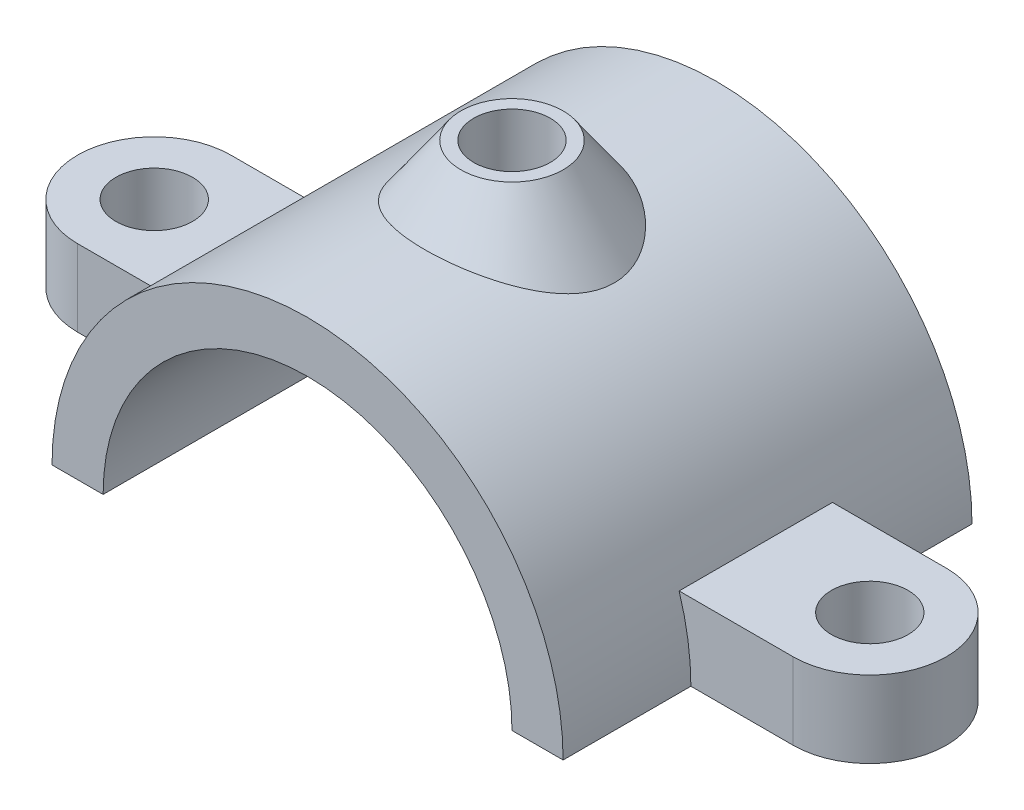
ISO-10303-21;
HEADER;
FILE_DESCRIPTION(('STEP AP214'),'2;1');
FILE_NAME('part.step','',(''),(''),'','','');
FILE_SCHEMA(('AUTOMOTIVE_DESIGN { 1 0 10303 214 1 1 1 1 }'));
ENDSEC;
DATA;
#1=APPLICATION_CONTEXT('core data for automotive mechanical design processes');
#2=APPLICATION_PROTOCOL_DEFINITION('international standard','automotive_design',2000,#1);
#3=PRODUCT_CONTEXT('',#1,'mechanical');
#4=PRODUCT('Part','Part','',(#3));
#5=PRODUCT_RELATED_PRODUCT_CATEGORY('part','',(#4));
#6=PRODUCT_DEFINITION_FORMATION('','',#4);
#7=PRODUCT_DEFINITION_CONTEXT('part definition',#1,'design');
#8=PRODUCT_DEFINITION('design','',#6,#7);
#9=PRODUCT_DEFINITION_SHAPE('','',#8);
#10=(LENGTH_UNIT() NAMED_UNIT(*) SI_UNIT(.MILLI.,.METRE.));
#11=(NAMED_UNIT(*) PLANE_ANGLE_UNIT() SI_UNIT($,.RADIAN.));
#12=(NAMED_UNIT(*) SI_UNIT($,.STERADIAN.) SOLID_ANGLE_UNIT());
#13=UNCERTAINTY_MEASURE_WITH_UNIT(LENGTH_MEASURE(1.E-05),#10,'distance_accuracy_value','');
#14=(GEOMETRIC_REPRESENTATION_CONTEXT(3) GLOBAL_UNCERTAINTY_ASSIGNED_CONTEXT((#13)) GLOBAL_UNIT_ASSIGNED_CONTEXT((#10,
#11,#12)) REPRESENTATION_CONTEXT('',''));
#15=CARTESIAN_POINT('',(0.,0.,0.));
#16=DIRECTION('',(0.,0.,1.));
#17=DIRECTION('',(1.,0.,0.));
#18=AXIS2_PLACEMENT_3D('',#15,#16,#17);
#19=CARTESIAN_POINT('',(0.,0.,40.));
#20=DIRECTION('',(0.,0.,-1.));
#21=DIRECTION('',(-1.,0.,0.));
#22=AXIS2_PLACEMENT_3D('',#19,#20,#21);
#23=CYLINDRICAL_SURFACE('',#22,50.);
#24=CARTESIAN_POINT('',(-13.3891413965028,48.1739648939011,-12.5382835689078));
#25=CARTESIAN_POINT('',(-13.7678496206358,48.0687121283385,-12.2425151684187));
#26=CARTESIAN_POINT('',(-14.1355399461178,47.9616998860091,-11.9333646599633));
#27=CARTESIAN_POINT('',(-14.8468065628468,47.7463122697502,-11.2886841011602));
#28=CARTESIAN_POINT('',(-15.1903786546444,47.6379366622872,-10.9531494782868));
#29=CARTESIAN_POINT('',(-15.8509248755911,47.4222415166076,-10.2561478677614));
#30=CARTESIAN_POINT('',(-16.1678850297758,47.3149225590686,-9.89466743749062));
#31=CARTESIAN_POINT('',(-16.7720702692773,47.1041398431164,-9.14660673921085));
#32=CARTESIAN_POINT('',(-17.0593004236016,47.0006754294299,-8.76003076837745));
#33=CARTESIAN_POINT('',(-17.5616027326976,46.8150736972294,-8.020280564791));
#34=CARTESIAN_POINT('',(-17.7811052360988,46.7320142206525,-7.6703446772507));
#35=CARTESIAN_POINT('',(-18.1935552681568,46.5729899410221,-6.95364153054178));
#36=CARTESIAN_POINT('',(-18.3865080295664,46.497023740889,-6.58687760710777));
#37=CARTESIAN_POINT('',(-18.7432827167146,46.3543555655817,-5.83786916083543));
#38=CARTESIAN_POINT('',(-18.9071182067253,46.2876492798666,-5.45563194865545));
#39=CARTESIAN_POINT('',(-19.2030720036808,46.1656546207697,-4.67748355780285));
#40=CARTESIAN_POINT('',(-19.3352073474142,46.1103601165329,-4.28157985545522));
#41=CARTESIAN_POINT('',(-19.5664669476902,46.0127083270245,-3.47443087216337));
#42=CARTESIAN_POINT('',(-19.6652603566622,45.9704810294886,-3.06307441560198));
#43=CARTESIAN_POINT('',(-19.8258361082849,45.9014586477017,-2.23188204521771));
#44=CARTESIAN_POINT('',(-19.8876188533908,45.8746633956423,-1.81204622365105));
#45=CARTESIAN_POINT('',(-19.9725953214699,45.8377312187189,-0.968068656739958));
#46=CARTESIAN_POINT('',(-19.9958190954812,45.8275813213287,-0.543930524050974));
#47=CARTESIAN_POINT('',(-20.0031474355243,45.8243836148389,0.304723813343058));
#48=CARTESIAN_POINT('',(-19.9872564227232,45.8313338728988,0.729239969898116));
#49=CARTESIAN_POINT('',(-19.9217501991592,45.8598393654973,1.51510585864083));
#50=CARTESIAN_POINT('',(-19.8771744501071,45.8792108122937,1.87696871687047));
#51=CARTESIAN_POINT('',(-19.7602683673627,45.9296837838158,2.59548308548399));
#52=CARTESIAN_POINT('',(-19.6879277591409,45.9607896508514,2.95213261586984));
#53=CARTESIAN_POINT('',(-19.5167211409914,46.0337509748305,3.65797367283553));
#54=CARTESIAN_POINT('',(-19.417846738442,46.0756098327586,4.0071628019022));
#55=CARTESIAN_POINT('',(-19.1951137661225,46.1688440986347,4.69619860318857));
#56=CARTESIAN_POINT('',(-19.0712503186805,46.2202213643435,5.03604343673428));
#57=CARTESIAN_POINT('',(-18.7634966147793,46.346152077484,5.79552561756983));
#58=CARTESIAN_POINT('',(-18.5724341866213,46.4232141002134,6.21185120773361));
#59=CARTESIAN_POINT('',(-18.1561339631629,46.5876039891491,7.02492625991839));
#60=CARTESIAN_POINT('',(-17.9308876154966,46.6749344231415,7.42167079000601));
#61=CARTESIAN_POINT('',(-17.4493029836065,46.8571034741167,8.1944991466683));
#62=CARTESIAN_POINT('',(-17.1929341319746,46.9519494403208,8.57056212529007));
#63=CARTESIAN_POINT('',(-16.6522854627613,47.1464092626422,9.3006488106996));
#64=CARTESIAN_POINT('',(-16.3680069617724,47.2460228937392,9.6546735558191));
#65=CARTESIAN_POINT('',(-15.7698163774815,47.4490684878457,10.3450848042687));
#66=CARTESIAN_POINT('',(-15.4555317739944,47.5525349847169,10.6811377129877));
#67=CARTESIAN_POINT('',(-14.8033495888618,47.7595843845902,11.3293994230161));
#68=CARTESIAN_POINT('',(-14.4654521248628,47.8631672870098,11.6416083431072));
#69=CARTESIAN_POINT('',(-13.768225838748,48.0683678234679,12.241673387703));
#70=CARTESIAN_POINT('',(-13.4088999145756,48.1699857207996,12.5295327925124));
#71=CARTESIAN_POINT('',(-12.6707051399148,48.3694062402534,13.0804654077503));
#72=CARTESIAN_POINT('',(-12.2918346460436,48.4672085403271,13.3435365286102));
#73=CARTESIAN_POINT('',(-11.4340767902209,48.677468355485,13.8974857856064));
#74=CARTESIAN_POINT('',(-10.9510211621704,48.788633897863,14.1824253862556));
#75=CARTESIAN_POINT('',(-9.96197434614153,49.0001518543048,14.7140163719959));
#76=CARTESIAN_POINT('',(-9.45598055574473,49.1005030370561,14.9606633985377));
#77=CARTESIAN_POINT('',(-8.42400419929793,49.2880437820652,15.414596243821));
#78=CARTESIAN_POINT('',(-7.89801333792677,49.3752278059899,15.6218655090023));
#79=CARTESIAN_POINT('',(-6.82953264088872,49.5343237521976,15.9957431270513));
#80=CARTESIAN_POINT('',(-6.2870429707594,49.606235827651,16.162351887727));
#81=CARTESIAN_POINT('',(-5.16464875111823,49.7358969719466,16.4602894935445));
#82=CARTESIAN_POINT('',(-4.58415159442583,49.7928770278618,16.589727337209));
#83=CARTESIAN_POINT('',(-3.41308071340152,49.8868314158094,16.8020359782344));
#84=CARTESIAN_POINT('',(-2.82250661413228,49.9238050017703,16.8849050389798));
#85=CARTESIAN_POINT('',(-1.63581969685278,49.9767621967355,17.0033363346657));
#86=CARTESIAN_POINT('',(-1.03970808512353,49.9927502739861,17.0389086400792));
#87=CARTESIAN_POINT('',(0.153630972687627,50.0033239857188,17.062452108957));
#88=CARTESIAN_POINT('',(0.750858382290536,49.9979103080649,17.0504248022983));
#89=CARTESIAN_POINT('',(1.92447799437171,49.9662976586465,16.9799316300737));
#90=CARTESIAN_POINT('',(2.50096941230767,49.9407101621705,16.9228318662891));
#91=CARTESIAN_POINT('',(3.64662073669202,49.8701466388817,16.7643664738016));
#92=CARTESIAN_POINT('',(4.21578076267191,49.8251709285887,16.6630015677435));
#93=CARTESIAN_POINT('',(5.34282720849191,49.7169458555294,16.4168130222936));
#94=CARTESIAN_POINT('',(5.90071385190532,49.6536968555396,16.2719902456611));
#95=CARTESIAN_POINT('',(7.00151077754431,49.5104730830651,15.9399261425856));
#96=CARTESIAN_POINT('',(7.54442079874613,49.4304980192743,15.752684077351));
#97=CARTESIAN_POINT('',(8.61615087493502,49.255042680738,15.3352468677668));
#98=CARTESIAN_POINT('',(9.14481786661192,49.1594400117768,15.1047103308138));
#99=CARTESIAN_POINT('',(10.1799423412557,48.9555621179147,14.6029582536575));
#100=CARTESIAN_POINT('',(10.6863994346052,48.8472866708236,14.3317420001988));
#101=CARTESIAN_POINT('',(11.6743902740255,48.6206315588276,13.7494547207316));
#102=CARTESIAN_POINT('',(12.1558917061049,48.5022392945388,13.4383337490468));
#103=CARTESIAN_POINT('',(13.0898770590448,48.2585542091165,12.7775900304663));
#104=CARTESIAN_POINT('',(13.5423610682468,48.1332614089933,12.4279674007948));
#105=CARTESIAN_POINT('',(14.4249796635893,47.8762587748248,11.6824770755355));
#106=CARTESIAN_POINT('',(14.8543352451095,47.7444672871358,11.2857130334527));
#107=CARTESIAN_POINT('',(15.6745270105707,47.4815195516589,10.4537302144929));
#108=CARTESIAN_POINT('',(16.0653561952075,47.3503634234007,10.0185044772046));
#109=CARTESIAN_POINT('',(16.8024518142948,47.0938380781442,9.11180361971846));
#110=CARTESIAN_POINT('',(17.148814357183,46.9684567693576,8.64041032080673));
#111=CARTESIAN_POINT('',(17.7918161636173,46.7286741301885,7.66234086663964));
#112=CARTESIAN_POINT('',(18.0884859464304,46.61426607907,7.15568663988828));
#113=CARTESIAN_POINT('',(18.5323574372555,46.4390719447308,6.29098533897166));
#114=CARTESIAN_POINT('',(18.6957603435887,46.3734285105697,5.94216987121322));
#115=CARTESIAN_POINT('',(18.9963113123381,46.2511240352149,5.23192070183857));
#116=CARTESIAN_POINT('',(19.1334670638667,46.1944603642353,4.87049073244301));
#117=CARTESIAN_POINT('',(19.3793590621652,46.091845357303,4.13699980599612));
#118=CARTESIAN_POINT('',(19.4881248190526,46.0458829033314,3.76495033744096));
#119=CARTESIAN_POINT('',(19.6755242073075,45.9661195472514,3.01200749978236));
#120=CARTESIAN_POINT('',(19.7541570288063,45.9323189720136,2.631113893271));
#121=CARTESIAN_POINT('',(19.8801040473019,45.8779492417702,1.86085016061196));
#122=CARTESIAN_POINT('',(19.9272266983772,45.8574610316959,1.47144279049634));
#123=CARTESIAN_POINT('',(19.98836125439,45.8308470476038,0.689537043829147));
#124=CARTESIAN_POINT('',(20.0023735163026,45.8247211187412,0.297038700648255));
#125=CARTESIAN_POINT('',(19.9969700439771,45.8270792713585,-0.487682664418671));
#126=CARTESIAN_POINT('',(19.9775540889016,45.8355634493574,-0.879905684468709));
#127=CARTESIAN_POINT('',(19.9057320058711,45.8668001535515,-1.6607240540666));
#128=CARTESIAN_POINT('',(19.8533268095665,45.889552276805,-2.04931950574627));
#129=CARTESIAN_POINT('',(19.7224118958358,45.9459580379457,-2.78741423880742));
#130=CARTESIAN_POINT('',(19.6464643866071,45.9785355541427,-3.13745592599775));
#131=CARTESIAN_POINT('',(19.4690781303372,46.0539279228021,-3.83001266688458));
#132=CARTESIAN_POINT('',(19.3676297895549,46.0967466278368,-4.17252483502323));
#133=CARTESIAN_POINT('',(19.1407265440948,46.1914242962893,-4.84828787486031));
#134=CARTESIAN_POINT('',(19.0152655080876,46.2432855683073,-5.18153635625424));
#135=CARTESIAN_POINT('',(18.7419553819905,46.3547288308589,-5.83741572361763));
#136=CARTESIAN_POINT('',(18.5941017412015,46.4143123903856,-6.16004443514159));
#137=CARTESIAN_POINT('',(18.2191914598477,46.5630255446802,-6.91065246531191));
#138=CARTESIAN_POINT('',(17.9830442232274,46.6549430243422,-7.33356157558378));
#139=CARTESIAN_POINT('',(17.4757628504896,46.8473189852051,-8.1558191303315));
#140=CARTESIAN_POINT('',(17.2046176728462,46.9477801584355,-8.55516008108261));
#141=CARTESIAN_POINT('',(16.6306102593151,47.1541717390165,-9.32953667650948));
#142=CARTESIAN_POINT('',(16.3277114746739,47.2601083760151,-9.70454349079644));
#143=CARTESIAN_POINT('',(15.6936257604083,47.4744363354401,-10.4289482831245));
#144=CARTESIAN_POINT('',(15.3624408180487,47.5828274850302,-10.7783480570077));
#145=CARTESIAN_POINT('',(14.6693387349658,47.8010927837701,-11.4560319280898));
#146=CARTESIAN_POINT('',(14.3070354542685,47.9109648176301,-11.7839211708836));
#147=CARTESIAN_POINT('',(13.5586113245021,48.128119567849,-12.4121799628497));
#148=CARTESIAN_POINT('',(13.1724904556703,48.2354022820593,-12.7125494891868));
#149=CARTESIAN_POINT('',(12.3787954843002,48.4451634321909,-13.2851144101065));
#150=CARTESIAN_POINT('',(11.9712258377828,48.5476428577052,-13.5573156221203));
#151=CARTESIAN_POINT('',(11.1367025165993,48.7458494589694,-14.0729584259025));
#152=CARTESIAN_POINT('',(10.7097476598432,48.8415762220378,-14.3163982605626));
#153=CARTESIAN_POINT('',(9.76304316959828,49.0403461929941,-14.8134205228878));
#154=CARTESIAN_POINT('',(9.24003048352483,49.1417844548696,-15.0614553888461));
#155=CARTESIAN_POINT('',(8.17360425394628,49.3303706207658,-15.5156748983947));
#156=CARTESIAN_POINT('',(7.63018869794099,49.4175171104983,-15.7218554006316));
#157=CARTESIAN_POINT('',(6.526459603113,49.5753579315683,-16.0911257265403));
#158=CARTESIAN_POINT('',(5.96614317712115,49.6460494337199,-16.2542081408));
#159=CARTESIAN_POINT('',(4.83252111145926,49.7691850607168,-16.5360743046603));
#160=CARTESIAN_POINT('',(4.25921587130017,49.8216297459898,-16.6548594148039));
#161=CARTESIAN_POINT('',(3.09852266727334,49.9073214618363,-16.848047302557));
#162=CARTESIAN_POINT('',(2.51105512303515,49.940395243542,-16.9220497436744));
#163=CARTESIAN_POINT('',(1.33129523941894,49.9857592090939,-17.0233800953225));
#164=CARTESIAN_POINT('',(0.739002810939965,49.998049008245,-17.0507071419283));
#165=CARTESIAN_POINT('',(-0.44604054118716,50.0015218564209,-17.0584384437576));
#166=CARTESIAN_POINT('',(-1.0387915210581,49.9927016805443,-17.0388355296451));
#167=CARTESIAN_POINT('',(-2.22018689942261,49.9541795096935,-16.9528699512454));
#168=CARTESIAN_POINT('',(-2.80883144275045,49.9244782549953,-16.8865089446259));
#169=CARTESIAN_POINT('',(-3.96285675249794,49.8459805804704,-16.7098810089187));
#170=CARTESIAN_POINT('',(-4.52844911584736,49.7976868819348,-16.6007687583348));
#171=CARTESIAN_POINT('',(-5.64778300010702,49.6831871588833,-16.3395226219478));
#172=CARTESIAN_POINT('',(-6.20152385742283,49.6169801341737,-16.1873863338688));
#173=CARTESIAN_POINT('',(-7.29292963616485,49.4683352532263,-15.8413294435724));
#174=CARTESIAN_POINT('',(-7.83061002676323,49.3859136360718,-15.6474506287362));
#175=CARTESIAN_POINT('',(-8.88687930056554,49.2068120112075,-15.219067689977));
#176=CARTESIAN_POINT('',(-9.40547294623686,49.1101355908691,-14.9845737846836));
#177=CARTESIAN_POINT('',(-10.52884137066,48.882901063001,-14.4218181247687));
#178=CARTESIAN_POINT('',(-11.1283955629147,48.749514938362,-14.0842248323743));
#179=CARTESIAN_POINT('',(-12.2891161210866,48.4699283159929,-13.3528803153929));
#180=CARTESIAN_POINT('',(-12.8502822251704,48.3237277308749,-12.9591287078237));
#181=CARTESIAN_POINT('',(-13.3891413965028,48.1739648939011,-12.5382835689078));
#182=B_SPLINE_CURVE_WITH_KNOTS('',3,(#24,#25,#26,#27,#28,#29,#30,#31,#32,#33,#34,#35,#36,#37,
#38,#39,#40,#41,#42,#43,#44,#45,#46,#47,#48,#49,#50,#51,#52,#53,#54,#55,#56,#57,#58,#59,#60,#61,
#62,#63,#64,#65,#66,#67,#68,#69,#70,#71,#72,#73,#74,#75,#76,#77,#78,#79,#80,#81,#82,#83,#84,#85,
#86,#87,#88,#89,#90,#91,#92,#93,#94,#95,#96,#97,#98,#99,#100,#101,#102,#103,#104,#105,#106,#107,
#108,#109,#110,#111,#112,#113,#114,#115,#116,#117,#118,#119,#120,#121,#122,#123,#124,#125,#126,
#127,#128,#129,#130,#131,#132,#133,#134,#135,#136,#137,#138,#139,#140,#141,#142,#143,#144,#145,
#146,#147,#148,#149,#150,#151,#152,#153,#154,#155,#156,#157,#158,#159,#160,#161,#162,#163,#164,
#165,#166,#167,#168,#169,#170,#171,#172,#173,#174,#175,#176,#177,#178,#179,#180,#181),
.UNSPECIFIED.,.T.,.F.,(4,2,2,2,2,2,2,2,2,2,2,2,2,2,2,2,2,2,2,2,2,2,2,2,2,2,2,2,2,2,2,2,2,2,2,2,
2,2,2,2,2,2,2,2,2,2,2,2,2,2,2,2,2,2,2,2,2,2,2,2,2,2,2,2,2,2,2,2,2,2,2,2,2,2,2,2,2,2,4),(0.,
1.47530725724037,2.95087076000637,4.42720435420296,5.90328581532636,7.16620373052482,
8.4288723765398,9.69095125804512,10.9523503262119,12.2259213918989,13.4994786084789,
14.7720428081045,16.044463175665,17.1385243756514,18.2329908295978,19.3278038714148,
20.4228308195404,21.8143684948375,23.2062548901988,24.5995195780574,25.9927185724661,
27.4062887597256,28.8198519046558,30.2332243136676,31.6467157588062,33.3600387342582,
35.0735565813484,36.7877931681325,38.5020125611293,40.2922106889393,42.082475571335,
43.8723592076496,45.662185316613,47.3997545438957,49.1372954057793,50.8748017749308,
52.6123384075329,54.36419986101,56.1160920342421,57.8701987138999,59.624300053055,
61.4197798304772,63.2155852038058,65.0074413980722,66.7981930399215,67.9693883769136,
69.1402400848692,70.3098698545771,71.4795310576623,72.6562393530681,73.8329349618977,
75.0096383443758,76.1863084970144,77.2641499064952,78.3423974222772,79.4209206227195,
80.4996632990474,81.9765849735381,83.453973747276,84.9330820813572,86.412086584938,
87.9132529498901,89.4144205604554,90.9152775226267,92.4162261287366,94.177169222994,
95.938286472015,97.6997062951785,99.461072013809,101.237959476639,103.014879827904,
104.792071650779,106.569200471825,108.301315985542,110.033528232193,111.764014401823,
113.494065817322,115.593247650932,117.692443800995),.UNSPECIFIED.);
#183=CARTESIAN_POINT('',(-13.3891413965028,48.1739648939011,-12.5382835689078));
#184=VERTEX_POINT('',#183);
#185=EDGE_CURVE('E223',#184,#184,#182,.T.);
#186=ORIENTED_EDGE('',*,*,#185,.F.);
#187=EDGE_LOOP('',(#186));
#188=FACE_BOUND('',#187,.T.);
#189=CARTESIAN_POINT('',(0.,0.,15.));
#190=DIRECTION('',(0.,0.,-1.));
#191=DIRECTION('',(-1.,0.,0.));
#192=AXIS2_PLACEMENT_3D('',#189,#190,#191);
#193=CIRCLE('',#192,50.);
#194=CARTESIAN_POINT('',(-50.,0.,15.));
#195=VERTEX_POINT('',#194);
#196=CARTESIAN_POINT('',(-47.6969600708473,15.,15.));
#197=VERTEX_POINT('',#196);
#198=EDGE_CURVE('E138',#195,#197,#193,.T.);
#199=ORIENTED_EDGE('',*,*,#198,.F.);
#200=DIRECTION('',(0.,0.,-1.));
#201=VECTOR('',#200,1.);
#202=CARTESIAN_POINT('',(-50.,0.,40.));
#203=LINE('',#202,#201);
#204=CARTESIAN_POINT('',(-50.,0.,40.));
#205=VERTEX_POINT('',#204);
#206=EDGE_CURVE('E228',#205,#195,#203,.T.);
#207=ORIENTED_EDGE('',*,*,#206,.F.);
#208=CARTESIAN_POINT('',(0.,0.,40.));
#209=DIRECTION('',(0.,0.,1.));
#210=DIRECTION('',(-1.,0.,0.));
#211=AXIS2_PLACEMENT_3D('',#208,#209,#210);
#212=CIRCLE('',#211,50.);
#213=CARTESIAN_POINT('',(50.,0.,40.));
#214=VERTEX_POINT('',#213);
#215=EDGE_CURVE('E265',#214,#205,#212,.T.);
#216=ORIENTED_EDGE('',*,*,#215,.F.);
#217=DIRECTION('',(0.,0.,-1.));
#218=VECTOR('',#217,1.);
#219=CARTESIAN_POINT('',(50.,0.,40.));
#220=LINE('',#219,#218);
#221=CARTESIAN_POINT('',(50.,0.,15.));
#222=VERTEX_POINT('',#221);
#223=EDGE_CURVE('E252',#214,#222,#220,.T.);
#224=ORIENTED_EDGE('',*,*,#223,.T.);
#225=CARTESIAN_POINT('',(0.,0.,15.));
#226=DIRECTION('',(0.,0.,1.));
#227=DIRECTION('',(1.,0.,0.));
#228=AXIS2_PLACEMENT_3D('',#225,#226,#227);
#229=CIRCLE('',#228,50.);
#230=CARTESIAN_POINT('',(47.6969600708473,15.,15.));
#231=VERTEX_POINT('',#230);
#232=EDGE_CURVE('E184',#222,#231,#229,.T.);
#233=ORIENTED_EDGE('',*,*,#232,.T.);
#234=DIRECTION('',(0.,0.,-1.));
#235=VECTOR('',#234,1.);
#236=CARTESIAN_POINT('',(47.6969600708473,15.,40.));
#237=LINE('',#236,#235);
#238=CARTESIAN_POINT('',(47.6969600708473,15.,-15.));
#239=VERTEX_POINT('',#238);
#240=EDGE_CURVE('E39',#239,#231,#237,.F.);
#241=ORIENTED_EDGE('',*,*,#240,.F.);
#242=CARTESIAN_POINT('',(0.,0.,-15.));
#243=DIRECTION('',(0.,0.,-1.));
#244=DIRECTION('',(-1.,0.,0.));
#245=AXIS2_PLACEMENT_3D('',#242,#243,#244);
#246=CIRCLE('',#245,50.);
#247=CARTESIAN_POINT('',(50.,0.,-15.));
#248=VERTEX_POINT('',#247);
#249=EDGE_CURVE('E179',#239,#248,#246,.T.);
#250=ORIENTED_EDGE('',*,*,#249,.T.);
#251=CARTESIAN_POINT('',(50.,0.,-40.));
#252=VERTEX_POINT('',#251);
#253=EDGE_CURVE('E247',#248,#252,#220,.T.);
#254=ORIENTED_EDGE('',*,*,#253,.T.);
#255=CARTESIAN_POINT('',(0.,0.,-40.));
#256=DIRECTION('',(0.,0.,1.));
#257=DIRECTION('',(-1.,0.,0.));
#258=AXIS2_PLACEMENT_3D('',#255,#256,#257);
#259=CIRCLE('',#258,50.);
#260=CARTESIAN_POINT('',(-50.,0.,-40.));
#261=VERTEX_POINT('',#260);
#262=EDGE_CURVE('E250',#252,#261,#259,.T.);
#263=ORIENTED_EDGE('',*,*,#262,.T.);
#264=CARTESIAN_POINT('',(-50.,0.,-15.));
#265=VERTEX_POINT('',#264);
#266=EDGE_CURVE('E279',#265,#261,#203,.T.);
#267=ORIENTED_EDGE('',*,*,#266,.F.);
#268=CARTESIAN_POINT('',(0.,0.,-15.));
#269=DIRECTION('',(0.,0.,1.));
#270=DIRECTION('',(1.,0.,0.));
#271=AXIS2_PLACEMENT_3D('',#268,#269,#270);
#272=CIRCLE('',#271,50.);
#273=CARTESIAN_POINT('',(-47.6969600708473,15.,-15.));
#274=VERTEX_POINT('',#273);
#275=EDGE_CURVE('E49',#274,#265,#272,.T.);
#276=ORIENTED_EDGE('',*,*,#275,.F.);
#277=DIRECTION('',(0.,0.,-1.));
#278=VECTOR('',#277,1.);
#279=CARTESIAN_POINT('',(-47.6969600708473,15.,40.));
#280=LINE('',#279,#278);
#281=EDGE_CURVE('E11',#197,#274,#280,.T.);
#282=ORIENTED_EDGE('',*,*,#281,.F.);
#283=EDGE_LOOP('',(#199,#207,#216,#224,#233,#241,#250,#254,#263,#267,#276,#282));
#284=FACE_BOUND('',#283,.T.);
#285=ADVANCED_FACE('F31',(#188,#284),#23,.T.);
#286=CARTESIAN_POINT('',(-40.,0.,40.));
#287=DIRECTION('',(0.,1.,0.));
#288=DIRECTION('',(0.,0.,1.));
#289=AXIS2_PLACEMENT_3D('',#286,#287,#288);
#290=PLANE('',#289);
#291=DIRECTION('',(1.,0.,0.));
#292=VECTOR('',#291,1.);
#293=CARTESIAN_POINT('',(-40.,0.,-40.));
#294=LINE('',#293,#292);
#295=CARTESIAN_POINT('',(-40.,0.,-40.));
#296=VERTEX_POINT('',#295);
#297=EDGE_CURVE('E270',#261,#296,#294,.T.);
#298=ORIENTED_EDGE('',*,*,#297,.T.);
#299=DIRECTION('',(0.,0.,-1.));
#300=VECTOR('',#299,1.);
#301=CARTESIAN_POINT('',(-40.,0.,40.));
#302=LINE('',#301,#300);
#303=CARTESIAN_POINT('',(-40.,0.,40.));
#304=VERTEX_POINT('',#303);
#305=EDGE_CURVE('E278',#304,#296,#302,.T.);
#306=ORIENTED_EDGE('',*,*,#305,.F.);
#307=DIRECTION('',(1.,0.,0.));
#308=VECTOR('',#307,1.);
#309=CARTESIAN_POINT('',(-40.,0.,40.));
#310=LINE('',#309,#308);
#311=EDGE_CURVE('E289',#205,#304,#310,.T.);
#312=ORIENTED_EDGE('',*,*,#311,.F.);
#313=ORIENTED_EDGE('',*,*,#206,.T.);
#314=DIRECTION('',(1.,0.,0.));
#315=VECTOR('',#314,1.);
#316=CARTESIAN_POINT('',(-70.,0.,15.));
#317=LINE('',#316,#315);
#318=CARTESIAN_POINT('',(-70.,0.,15.));
#319=VERTEX_POINT('',#318);
#320=EDGE_CURVE('E147',#319,#195,#317,.T.);
#321=ORIENTED_EDGE('',*,*,#320,.F.);
#322=CARTESIAN_POINT('',(-70.,0.,0.));
#323=DIRECTION('',(0.,1.,0.));
#324=DIRECTION('',(0.,0.,-1.));
#325=AXIS2_PLACEMENT_3D('',#322,#323,#324);
#326=CIRCLE('',#325,15.);
#327=CARTESIAN_POINT('',(-70.,0.,-15.));
#328=VERTEX_POINT('',#327);
#329=EDGE_CURVE('E131',#328,#319,#326,.T.);
#330=ORIENTED_EDGE('',*,*,#329,.F.);
#331=DIRECTION('',(-1.,0.,0.));
#332=VECTOR('',#331,1.);
#333=CARTESIAN_POINT('',(-40.,0.,-15.));
#334=LINE('',#333,#332);
#335=EDGE_CURVE('E139',#265,#328,#334,.T.);
#336=ORIENTED_EDGE('',*,*,#335,.F.);
#337=ORIENTED_EDGE('',*,*,#266,.T.);
#338=EDGE_LOOP('',(#298,#306,#312,#313,#321,#330,#336,#337));
#339=FACE_BOUND('',#338,.T.);
#340=CARTESIAN_POINT('',(-70.,0.,0.));
#341=DIRECTION('',(0.,1.,0.));
#342=DIRECTION('',(0.,0.,-1.));
#343=AXIS2_PLACEMENT_3D('',#340,#341,#342);
#344=CIRCLE('',#343,7.50000000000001);
#345=CARTESIAN_POINT('',(-70.,0.,-7.50000000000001));
#346=VERTEX_POINT('',#345);
#347=EDGE_CURVE('E143',#346,#346,#344,.T.);
#348=ORIENTED_EDGE('',*,*,#347,.T.);
#349=EDGE_LOOP('',(#348));
#350=FACE_BOUND('',#349,.T.);
#351=ADVANCED_FACE('F287',(#339,#350),#290,.F.);
#352=CARTESIAN_POINT('',(0.,0.,40.));
#353=DIRECTION('',(0.,0.,-1.));
#354=DIRECTION('',(-1.,0.,0.));
#355=AXIS2_PLACEMENT_3D('',#352,#353,#354);
#356=CYLINDRICAL_SURFACE('',#355,40.);
#357=CARTESIAN_POINT('',(0.,40.,7.5));
#358=CARTESIAN_POINT('',(0.208750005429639,40.0000018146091,7.50000377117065));
#359=CARTESIAN_POINT('',(0.417451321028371,39.9983629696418,7.49128225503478));
#360=CARTESIAN_POINT('',(0.833413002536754,39.9918572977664,7.45647137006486));
#361=CARTESIAN_POINT('',(1.04067310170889,39.9869898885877,7.43037886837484));
#362=CARTESIAN_POINT('',(1.45231077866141,39.9741571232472,7.36100481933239));
#363=CARTESIAN_POINT('',(1.65668666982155,39.9661900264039,7.31771361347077));
#364=CARTESIAN_POINT('',(2.06106821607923,39.9473776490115,7.2142614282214));
#365=CARTESIAN_POINT('',(2.26107223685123,39.9365313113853,7.15409425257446));
#366=CARTESIAN_POINT('',(2.65497439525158,39.9122788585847,7.01744361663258));
#367=CARTESIAN_POINT('',(2.84888005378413,39.8988760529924,6.94098123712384));
#368=CARTESIAN_POINT('',(3.22959116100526,39.8698658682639,6.77223092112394));
#369=CARTESIAN_POINT('',(3.41639396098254,39.8542576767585,6.67993715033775));
#370=CARTESIAN_POINT('',(3.78147202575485,39.8212763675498,6.48025757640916));
#371=CARTESIAN_POINT('',(3.95975122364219,39.8039040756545,6.37287882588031));
#372=CARTESIAN_POINT('',(4.30674780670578,39.7678559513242,6.14370991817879));
#373=CARTESIAN_POINT('',(4.47546159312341,39.7491796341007,6.0219143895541));
#374=CARTESIAN_POINT('',(4.80383014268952,39.7108401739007,5.76344727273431));
#375=CARTESIAN_POINT('',(4.96337292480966,39.6911688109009,5.6266346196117));
#376=CARTESIAN_POINT('',(5.27045902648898,39.6515604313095,5.34007334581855));
#377=CARTESIAN_POINT('',(5.41799787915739,39.6316233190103,5.19031995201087));
#378=CARTESIAN_POINT('',(5.69996538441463,39.5920530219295,4.87898453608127));
#379=CARTESIAN_POINT('',(5.83439788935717,39.5724197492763,4.71740601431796));
#380=CARTESIAN_POINT('',(6.08932223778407,39.5339952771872,4.38341253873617));
#381=CARTESIAN_POINT('',(6.20980892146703,39.5152043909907,4.2109936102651));
#382=CARTESIAN_POINT('',(6.43681359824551,39.4788646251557,3.85516665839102));
#383=CARTESIAN_POINT('',(6.54321610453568,39.461326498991,3.67168382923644));
#384=CARTESIAN_POINT('',(6.74016524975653,39.4281644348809,3.29622689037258));
#385=CARTESIAN_POINT('',(6.83071170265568,39.4125405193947,3.10425268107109));
#386=CARTESIAN_POINT('',(6.99525813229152,39.3836685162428,2.71318301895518));
#387=CARTESIAN_POINT('',(7.06925945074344,39.370420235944,2.51408814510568));
#388=CARTESIAN_POINT('',(7.20015170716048,39.3466929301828,2.11018533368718));
#389=CARTESIAN_POINT('',(7.25704246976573,39.3362139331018,1.90537733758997));
#390=CARTESIAN_POINT('',(7.352702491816,39.3184448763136,1.49393997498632));
#391=CARTESIAN_POINT('',(7.39167387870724,39.3111193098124,1.28735912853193));
#392=CARTESIAN_POINT('',(7.4521472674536,39.2997003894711,0.871569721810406));
#393=CARTESIAN_POINT('',(7.47364958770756,39.2956069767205,0.662361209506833));
#394=CARTESIAN_POINT('',(7.49901166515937,39.2907748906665,0.242854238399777));
#395=CARTESIAN_POINT('',(7.50287272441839,39.2900359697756,0.0325558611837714));
#396=CARTESIAN_POINT('',(7.49292465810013,39.2919343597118,-0.387606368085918));
#397=CARTESIAN_POINT('',(7.47911563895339,39.2945716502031,-0.597470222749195));
#398=CARTESIAN_POINT('',(7.43424108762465,39.3030860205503,-1.01243631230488));
#399=CARTESIAN_POINT('',(7.40340869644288,39.3089193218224,-1.21756469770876));
#400=CARTESIAN_POINT('',(7.32488121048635,39.323627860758,-1.62452545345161));
#401=CARTESIAN_POINT('',(7.27718035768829,39.3325041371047,-1.82635667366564));
#402=CARTESIAN_POINT('',(7.16529025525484,39.3530411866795,-2.22519150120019));
#403=CARTESIAN_POINT('',(7.10110642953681,39.3647010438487,-2.4221966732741));
#404=CARTESIAN_POINT('',(6.95673659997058,39.3904705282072,-2.81011155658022));
#405=CARTESIAN_POINT('',(6.8765446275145,39.4045810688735,-3.0010189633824));
#406=CARTESIAN_POINT('',(6.61176464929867,39.4501830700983,-3.56471307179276));
#407=CARTESIAN_POINT('',(6.40353274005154,39.4848365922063,-3.92648060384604));
#408=CARTESIAN_POINT('',(5.93044638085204,39.5586511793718,-4.61008539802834));
#409=CARTESIAN_POINT('',(5.66558618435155,39.5978127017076,-4.93191860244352));
#410=CARTESIAN_POINT('',(5.0817013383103,39.6769993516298,-5.53210785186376));
#411=CARTESIAN_POINT('',(4.76188882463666,39.7170283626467,-5.80969873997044));
#412=CARTESIAN_POINT('',(4.07983854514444,39.7928694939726,-6.30739072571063));
#413=CARTESIAN_POINT('',(3.71760035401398,39.8286815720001,-6.52749124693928));
#414=CARTESIAN_POINT('',(2.96017545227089,39.8921269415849,-6.90408760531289));
#415=CARTESIAN_POINT('',(2.56494821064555,39.9197499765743,-7.06050377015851));
#416=CARTESIAN_POINT('',(1.75319518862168,39.9636252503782,-7.30451059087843));
#417=CARTESIAN_POINT('',(1.33667167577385,39.9798786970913,-7.39210855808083));
#418=CARTESIAN_POINT('',(0.500744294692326,39.9990181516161,-7.49493080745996));
#419=CARTESIAN_POINT('',(0.0814737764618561,40.0020980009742,-7.51120466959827));
#420=CARTESIAN_POINT('',(-0.753809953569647,39.9950767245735,-7.47371989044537));
#421=CARTESIAN_POINT('',(-1.16982332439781,39.98497624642,-7.41996468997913));
#422=CARTESIAN_POINT('',(-1.98339415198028,39.9528572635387,-7.24486493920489));
#423=CARTESIAN_POINT('',(-2.38107031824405,39.9309323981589,-7.12405122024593));
#424=CARTESIAN_POINT('',(-3.15069414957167,39.8775858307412,-6.81867383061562));
#425=CARTESIAN_POINT('',(-3.52264006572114,39.8461634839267,-6.63410583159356));
#426=CARTESIAN_POINT('',(-4.05529880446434,39.7943106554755,-6.31256049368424));
#427=CARTESIAN_POINT('',(-4.2295913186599,39.7761185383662,-6.19711569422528));
#428=CARTESIAN_POINT('',(-4.56785316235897,39.7386912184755,-5.95216291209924));
#429=CARTESIAN_POINT('',(-4.73182609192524,39.7194563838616,-5.82265987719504));
#430=CARTESIAN_POINT('',(-5.04842258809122,39.6804600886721,-5.55041076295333));
#431=CARTESIAN_POINT('',(-5.20104108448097,39.6606983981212,-5.40765883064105));
#432=CARTESIAN_POINT('',(-5.4937909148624,39.621207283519,-5.10997248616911));
#433=CARTESIAN_POINT('',(-5.63392671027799,39.6014778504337,-4.95504246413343));
#434=CARTESIAN_POINT('',(-5.90264796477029,39.5623235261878,-4.63179501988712));
#435=CARTESIAN_POINT('',(-6.03104923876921,39.542906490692,-4.46332348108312));
#436=CARTESIAN_POINT('',(-6.27315502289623,39.5052216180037,-4.11610292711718));
#437=CARTESIAN_POINT('',(-6.38686493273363,39.4869533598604,-3.93735772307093));
#438=CARTESIAN_POINT('',(-6.59886017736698,39.4520797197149,-3.57070083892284));
#439=CARTESIAN_POINT('',(-6.69714001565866,39.4354749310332,-3.38278592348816));
#440=CARTESIAN_POINT('',(-6.87746127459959,39.4044274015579,-2.9992356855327));
#441=CARTESIAN_POINT('',(-6.95950899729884,39.3899838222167,-2.80360339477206));
#442=CARTESIAN_POINT('',(-7.10645568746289,39.3637375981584,-2.40683213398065));
#443=CARTESIAN_POINT('',(-7.1714301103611,39.3519233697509,-2.20572188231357));
#444=CARTESIAN_POINT('',(-7.28418636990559,39.33120793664,-1.79866972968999));
#445=CARTESIAN_POINT('',(-7.3319745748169,39.3223056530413,-1.59272964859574));
#446=CARTESIAN_POINT('',(-7.41001514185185,39.3076742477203,-1.17742182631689));
#447=CARTESIAN_POINT('',(-7.4402659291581,39.3019454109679,-0.968053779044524));
#448=CARTESIAN_POINT('',(-7.48297956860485,39.2938352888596,-0.547447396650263));
#449=CARTESIAN_POINT('',(-7.49544263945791,39.2914539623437,-0.336209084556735));
#450=CARTESIAN_POINT('',(-7.50242336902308,39.2901215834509,0.0831741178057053));
#451=CARTESIAN_POINT('',(-7.49722631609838,39.2911159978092,0.291314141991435));
#452=CARTESIAN_POINT('',(-7.46955090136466,39.2963866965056,0.706473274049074));
#453=CARTESIAN_POINT('',(-7.44706654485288,39.3006641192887,0.913491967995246));
#454=CARTESIAN_POINT('',(-7.38499291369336,39.3123755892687,1.32481369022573));
#455=CARTESIAN_POINT('',(-7.34540711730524,39.3198089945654,1.5291172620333));
#456=CARTESIAN_POINT('',(-7.2494375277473,39.3376160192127,1.93361428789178));
#457=CARTESIAN_POINT('',(-7.19305323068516,39.3479897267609,2.13380761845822));
#458=CARTESIAN_POINT('',(-7.06403915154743,39.3713555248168,2.52830745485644));
#459=CARTESIAN_POINT('',(-6.99144041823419,39.384342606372,2.72262441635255));
#460=CARTESIAN_POINT('',(-6.83047400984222,39.4125779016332,3.1044401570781));
#461=CARTESIAN_POINT('',(-6.74210638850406,39.4278261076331,3.29193895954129));
#462=CARTESIAN_POINT('',(-6.55023148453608,39.4601562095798,3.65887062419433));
#463=CARTESIAN_POINT('',(-6.4467232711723,39.4772382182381,3.8383029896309));
#464=CARTESIAN_POINT('',(-6.22529681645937,39.512760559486,4.18789828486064));
#465=CARTESIAN_POINT('',(-6.10737866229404,39.531200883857,4.35806127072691));
#466=CARTESIAN_POINT('',(-5.85604152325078,39.5692199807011,4.69050697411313));
#467=CARTESIAN_POINT('',(-5.72241450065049,39.5888117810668,4.85263095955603));
#468=CARTESIAN_POINT('',(-5.44210850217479,39.6283165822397,5.16502476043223));
#469=CARTESIAN_POINT('',(-5.29543414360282,39.6482294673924,5.31529873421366));
#470=CARTESIAN_POINT('',(-4.98989811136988,39.6878401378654,5.60312333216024));
#471=CARTESIAN_POINT('',(-4.8310292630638,39.7075377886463,5.74066635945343));
#472=CARTESIAN_POINT('',(-4.50231607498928,39.7461510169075,6.00193406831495));
#473=CARTESIAN_POINT('',(-4.33247580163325,39.7650668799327,6.12566382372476));
#474=CARTESIAN_POINT('',(-3.98126969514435,39.801770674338,6.35959306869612));
#475=CARTESIAN_POINT('',(-3.79981050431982,39.8195463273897,6.46965439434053));
#476=CARTESIAN_POINT('',(-3.42815726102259,39.8532625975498,6.67403161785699));
#477=CARTESIAN_POINT('',(-3.23796645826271,39.8692038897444,6.76835331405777));
#478=CARTESIAN_POINT('',(-2.85024127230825,39.8987955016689,6.94053893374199));
#479=CARTESIAN_POINT('',(-2.6527116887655,39.9124472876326,7.01841339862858));
#480=CARTESIAN_POINT('',(-2.25167735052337,39.9370797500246,7.15716306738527));
#481=CARTESIAN_POINT('',(-2.04817380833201,39.9480609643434,7.21804169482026));
#482=CARTESIAN_POINT('',(-1.54187254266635,39.9714011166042,7.34633429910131));
#483=CARTESIAN_POINT('',(-1.23643982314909,39.9820722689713,7.40388445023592));
#484=CARTESIAN_POINT('',(-0.620635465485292,39.9963702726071,7.4807140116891));
#485=CARTESIAN_POINT('',(-0.310263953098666,39.9999973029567,7.49999439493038));
#486=CARTESIAN_POINT('',(0.,40.,7.5));
#487=B_SPLINE_CURVE_WITH_KNOTS('',3,(#357,#358,#359,#360,#361,#362,#363,#364,#365,#366,#367,
#368,#369,#370,#371,#372,#373,#374,#375,#376,#377,#378,#379,#380,#381,#382,#383,#384,#385,#386,
#387,#388,#389,#390,#391,#392,#393,#394,#395,#396,#397,#398,#399,#400,#401,#402,#403,#404,#405,
#406,#407,#408,#409,#410,#411,#412,#413,#414,#415,#416,#417,#418,#419,#420,#421,#422,#423,#424,
#425,#426,#427,#428,#429,#430,#431,#432,#433,#434,#435,#436,#437,#438,#439,#440,#441,#442,#443,
#444,#445,#446,#447,#448,#449,#450,#451,#452,#453,#454,#455,#456,#457,#458,#459,#460,#461,#462,
#463,#464,#465,#466,#467,#468,#469,#470,#471,#472,#473,#474,#475,#476,#477,#478,#479,#480,#481,
#482,#483,#484,#485,#486),.UNSPECIFIED.,.T.,.F.,(4,2,2,2,2,2,2,2,2,2,2,2,2,2,2,2,2,2,2,2,2,2,2,
2,2,2,2,2,2,2,2,2,2,2,2,2,2,2,2,2,2,2,2,2,2,2,2,2,2,2,2,2,2,2,2,2,2,2,2,2,2,2,2,2,4),(0.,
0.62597777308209,1.25206847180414,1.87851127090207,2.50518437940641,3.13105164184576,
3.75715005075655,4.38295671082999,5.00899727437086,5.64152469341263,6.27428642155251,
6.90686159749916,7.53967007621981,8.17738252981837,8.81510246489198,9.45277066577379,
10.0904454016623,10.7207393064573,11.3510217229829,11.981257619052,12.6114897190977,
13.2332972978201,13.855317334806,14.4771329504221,15.0991808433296,16.3494134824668,
17.5997730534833,18.8698387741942,20.1399172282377,21.4115797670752,22.6831071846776,
23.9358590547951,25.1885493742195,26.4314620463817,27.6744591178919,28.3034055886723,
28.9321314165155,29.5611363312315,30.1899155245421,30.8272944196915,31.4644383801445,
32.1018087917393,32.7389312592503,33.3731887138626,34.0072109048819,34.6412900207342,
35.2753613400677,35.8992386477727,36.5233323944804,37.1472992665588,37.7712848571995,
38.3940856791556,39.0168843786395,39.6397213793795,40.2625546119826,40.8948376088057,
41.5268977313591,42.1593326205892,42.7915344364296,43.429680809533,44.0675915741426,
44.7050922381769,45.3424643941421,46.2728752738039,47.2032624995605),.UNSPECIFIED.);
#488=CARTESIAN_POINT('',(0.,40.,7.5));
#489=VERTEX_POINT('',#488);
#490=EDGE_CURVE('E189',#489,#489,#487,.T.);
#491=ORIENTED_EDGE('',*,*,#490,.T.);
#492=EDGE_LOOP('',(#491));
#493=FACE_BOUND('',#492,.T.);
#494=CARTESIAN_POINT('',(0.,0.,-40.));
#495=DIRECTION('',(0.,0.,-1.));
#496=DIRECTION('',(-1.,0.,0.));
#497=AXIS2_PLACEMENT_3D('',#494,#495,#496);
#498=CIRCLE('',#497,40.);
#499=CARTESIAN_POINT('',(40.,0.,-40.));
#500=VERTEX_POINT('',#499);
#501=EDGE_CURVE('E266',#296,#500,#498,.T.);
#502=ORIENTED_EDGE('',*,*,#501,.T.);
#503=DIRECTION('',(0.,0.,-1.));
#504=VECTOR('',#503,1.);
#505=CARTESIAN_POINT('',(40.,0.,40.));
#506=LINE('',#505,#504);
#507=CARTESIAN_POINT('',(40.,0.,40.));
#508=VERTEX_POINT('',#507);
#509=EDGE_CURVE('E261',#508,#500,#506,.T.);
#510=ORIENTED_EDGE('',*,*,#509,.F.);
#511=CARTESIAN_POINT('',(0.,0.,40.));
#512=DIRECTION('',(0.,0.,-1.));
#513=DIRECTION('',(-1.,0.,0.));
#514=AXIS2_PLACEMENT_3D('',#511,#512,#513);
#515=CIRCLE('',#514,40.);
#516=EDGE_CURVE('E294',#304,#508,#515,.T.);
#517=ORIENTED_EDGE('',*,*,#516,.F.);
#518=ORIENTED_EDGE('',*,*,#305,.T.);
#519=EDGE_LOOP('',(#502,#510,#517,#518));
#520=FACE_BOUND('',#519,.T.);
#521=ADVANCED_FACE('F198',(#493,#520),#356,.F.);
#522=CARTESIAN_POINT('',(50.,0.,40.));
#523=DIRECTION('',(0.,1.,0.));
#524=DIRECTION('',(0.,0.,1.));
#525=AXIS2_PLACEMENT_3D('',#522,#523,#524);
#526=PLANE('',#525);
#527=ORIENTED_EDGE('',*,*,#253,.F.);
#528=DIRECTION('',(1.,0.,0.));
#529=VECTOR('',#528,1.);
#530=CARTESIAN_POINT('',(40.,0.,-15.));
#531=LINE('',#530,#529);
#532=CARTESIAN_POINT('',(70.,0.,-15.));
#533=VERTEX_POINT('',#532);
#534=EDGE_CURVE('E173',#248,#533,#531,.T.);
#535=ORIENTED_EDGE('',*,*,#534,.T.);
#536=CARTESIAN_POINT('',(70.,0.,0.));
#537=DIRECTION('',(0.,-1.,0.));
#538=DIRECTION('',(0.,0.,-1.));
#539=AXIS2_PLACEMENT_3D('',#536,#537,#538);
#540=CIRCLE('',#539,15.);
#541=CARTESIAN_POINT('',(70.,0.,15.));
#542=VERTEX_POINT('',#541);
#543=EDGE_CURVE('E165',#533,#542,#540,.T.);
#544=ORIENTED_EDGE('',*,*,#543,.T.);
#545=DIRECTION('',(-1.,0.,0.));
#546=VECTOR('',#545,1.);
#547=CARTESIAN_POINT('',(70.,0.,15.));
#548=LINE('',#547,#546);
#549=EDGE_CURVE('E158',#542,#222,#548,.T.);
#550=ORIENTED_EDGE('',*,*,#549,.T.);
#551=ORIENTED_EDGE('',*,*,#223,.F.);
#552=DIRECTION('',(1.,0.,0.));
#553=VECTOR('',#552,1.);
#554=CARTESIAN_POINT('',(50.,0.,40.));
#555=LINE('',#554,#553);
#556=EDGE_CURVE('E253',#508,#214,#555,.T.);
#557=ORIENTED_EDGE('',*,*,#556,.F.);
#558=ORIENTED_EDGE('',*,*,#509,.T.);
#559=DIRECTION('',(1.,0.,0.));
#560=VECTOR('',#559,1.);
#561=CARTESIAN_POINT('',(50.,0.,-40.));
#562=LINE('',#561,#560);
#563=EDGE_CURVE('E256',#500,#252,#562,.T.);
#564=ORIENTED_EDGE('',*,*,#563,.T.);
#565=EDGE_LOOP('',(#527,#535,#544,#550,#551,#557,#558,#564));
#566=FACE_BOUND('',#565,.T.);
#567=CARTESIAN_POINT('',(70.,0.,0.));
#568=DIRECTION('',(0.,-1.,0.));
#569=DIRECTION('',(0.,0.,-1.));
#570=AXIS2_PLACEMENT_3D('',#567,#568,#569);
#571=CIRCLE('',#570,7.50000000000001);
#572=CARTESIAN_POINT('',(70.,0.,-7.50000000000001));
#573=VERTEX_POINT('',#572);
#574=EDGE_CURVE('E154',#573,#573,#571,.T.);
#575=ORIENTED_EDGE('',*,*,#574,.F.);
#576=EDGE_LOOP('',(#575));
#577=FACE_BOUND('',#576,.T.);
#578=ADVANCED_FACE('F257',(#566,#577),#526,.F.);
#579=CARTESIAN_POINT('',(0.,0.,40.));
#580=DIRECTION('',(0.,0.,-1.));
#581=DIRECTION('',(-1.,0.,0.));
#582=AXIS2_PLACEMENT_3D('',#579,#580,#581);
#583=PLANE('',#582);
#584=ORIENTED_EDGE('',*,*,#215,.T.);
#585=ORIENTED_EDGE('',*,*,#311,.T.);
#586=ORIENTED_EDGE('',*,*,#516,.T.);
#587=ORIENTED_EDGE('',*,*,#556,.T.);
#588=EDGE_LOOP('',(#584,#585,#586,#587));
#589=FACE_BOUND('',#588,.T.);
#590=ADVANCED_FACE('F220',(#589),#583,.F.);
#591=CARTESIAN_POINT('',(0.,0.,-40.));
#592=DIRECTION('',(0.,0.,-1.));
#593=DIRECTION('',(-1.,0.,0.));
#594=AXIS2_PLACEMENT_3D('',#591,#592,#593);
#595=PLANE('',#594);
#596=ORIENTED_EDGE('',*,*,#262,.F.);
#597=ORIENTED_EDGE('',*,*,#563,.F.);
#598=ORIENTED_EDGE('',*,*,#501,.F.);
#599=ORIENTED_EDGE('',*,*,#297,.F.);
#600=EDGE_LOOP('',(#596,#597,#598,#599));
#601=FACE_BOUND('',#600,.T.);
#602=ADVANCED_FACE('F218',(#601),#595,.T.);
#603=CARTESIAN_POINT('',(0.,60.,0.));
#604=DIRECTION('',(0.,-1.,0.));
#605=DIRECTION('',(0.,0.,-1.));
#606=AXIS2_PLACEMENT_3D('',#603,#604,#605);
#607=CONICAL_SURFACE('',#606,10.,0.61441107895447);
#608=CARTESIAN_POINT('',(0.,60.,0.));
#609=DIRECTION('',(0.,-1.,0.));
#610=DIRECTION('',(0.,0.,-1.));
#611=AXIS2_PLACEMENT_3D('',#608,#609,#610);
#612=CIRCLE('',#611,10.);
#613=CARTESIAN_POINT('',(0.,60.,-10.));
#614=VERTEX_POINT('',#613);
#615=EDGE_CURVE('E196',#614,#614,#612,.T.);
#616=ORIENTED_EDGE('',*,*,#615,.T.);
#617=EDGE_LOOP('',(#616));
#618=FACE_BOUND('',#617,.T.);
#619=ORIENTED_EDGE('',*,*,#185,.T.);
#620=EDGE_LOOP('',(#619));
#621=FACE_BOUND('',#620,.T.);
#622=ADVANCED_FACE('F213',(#618,#621),#607,.T.);
#623=CARTESIAN_POINT('',(0.,60.,0.));
#624=DIRECTION('',(0.,-1.,0.));
#625=DIRECTION('',(0.,0.,-1.));
#626=AXIS2_PLACEMENT_3D('',#623,#624,#625);
#627=PLANE('',#626);
#628=CARTESIAN_POINT('',(0.,60.,0.));
#629=DIRECTION('',(0.,1.,0.));
#630=DIRECTION('',(0.,0.,1.));
#631=AXIS2_PLACEMENT_3D('',#628,#629,#630);
#632=CIRCLE('',#631,7.5);
#633=CARTESIAN_POINT('',(0.,60.,7.5));
#634=VERTEX_POINT('',#633);
#635=EDGE_CURVE('E186',#634,#634,#632,.T.);
#636=ORIENTED_EDGE('',*,*,#635,.F.);
#637=EDGE_LOOP('',(#636));
#638=FACE_BOUND('',#637,.T.);
#639=ORIENTED_EDGE('',*,*,#615,.F.);
#640=EDGE_LOOP('',(#639));
#641=FACE_BOUND('',#640,.T.);
#642=ADVANCED_FACE('F207',(#638,#641),#627,.F.);
#643=CARTESIAN_POINT('',(0.,0.,0.));
#644=DIRECTION('',(0.,1.,0.));
#645=DIRECTION('',(0.,0.,1.));
#646=AXIS2_PLACEMENT_3D('',#643,#644,#645);
#647=CYLINDRICAL_SURFACE('',#646,7.5);
#648=ORIENTED_EDGE('',*,*,#635,.T.);
#649=EDGE_LOOP('',(#648));
#650=FACE_BOUND('',#649,.T.);
#651=ORIENTED_EDGE('',*,*,#490,.F.);
#652=EDGE_LOOP('',(#651));
#653=FACE_BOUND('',#652,.T.);
#654=ADVANCED_FACE('F201',(#650,#653),#647,.F.);
#655=CARTESIAN_POINT('',(70.,15.,0.));
#656=DIRECTION('',(0.,-1.,0.));
#657=DIRECTION('',(0.,0.,-1.));
#658=AXIS2_PLACEMENT_3D('',#655,#656,#657);
#659=PLANE('',#658);
#660=CARTESIAN_POINT('',(70.,15.,0.));
#661=DIRECTION('',(0.,-1.,0.));
#662=DIRECTION('',(0.,0.,-1.));
#663=AXIS2_PLACEMENT_3D('',#660,#661,#662);
#664=CIRCLE('',#663,7.50000000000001);
#665=CARTESIAN_POINT('',(70.,15.,-7.50000000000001));
#666=VERTEX_POINT('',#665);
#667=EDGE_CURVE('E155',#666,#666,#664,.T.);
#668=ORIENTED_EDGE('',*,*,#667,.T.);
#669=EDGE_LOOP('',(#668));
#670=FACE_BOUND('',#669,.T.);
#671=DIRECTION('',(1.,0.,0.));
#672=VECTOR('',#671,1.);
#673=CARTESIAN_POINT('',(40.,15.,-15.));
#674=LINE('',#673,#672);
#675=CARTESIAN_POINT('',(70.,15.,-15.));
#676=VERTEX_POINT('',#675);
#677=EDGE_CURVE('E164',#239,#676,#674,.T.);
#678=ORIENTED_EDGE('',*,*,#677,.F.);
#679=ORIENTED_EDGE('',*,*,#240,.T.);
#680=DIRECTION('',(-1.,0.,0.));
#681=VECTOR('',#680,1.);
#682=CARTESIAN_POINT('',(70.,15.,15.));
#683=LINE('',#682,#681);
#684=CARTESIAN_POINT('',(70.,15.,15.));
#685=VERTEX_POINT('',#684);
#686=EDGE_CURVE('E161',#685,#231,#683,.T.);
#687=ORIENTED_EDGE('',*,*,#686,.F.);
#688=CARTESIAN_POINT('',(70.,15.,0.));
#689=DIRECTION('',(0.,-1.,0.));
#690=DIRECTION('',(0.,0.,-1.));
#691=AXIS2_PLACEMENT_3D('',#688,#689,#690);
#692=CIRCLE('',#691,15.);
#693=EDGE_CURVE('E167',#676,#685,#692,.T.);
#694=ORIENTED_EDGE('',*,*,#693,.F.);
#695=EDGE_LOOP('',(#678,#679,#687,#694));
#696=FACE_BOUND('',#695,.T.);
#697=ADVANCED_FACE('F206',(#670,#696),#659,.F.);
#698=CARTESIAN_POINT('',(70.,15.,15.));
#699=DIRECTION('',(0.,0.,1.));
#700=DIRECTION('',(1.,0.,0.));
#701=AXIS2_PLACEMENT_3D('',#698,#699,#700);
#702=PLANE('',#701);
#703=ORIENTED_EDGE('',*,*,#232,.F.);
#704=ORIENTED_EDGE('',*,*,#549,.F.);
#705=DIRECTION('',(0.,-1.,0.));
#706=VECTOR('',#705,1.);
#707=CARTESIAN_POINT('',(70.,15.,15.));
#708=LINE('',#707,#706);
#709=EDGE_CURVE('E177',#685,#542,#708,.T.);
#710=ORIENTED_EDGE('',*,*,#709,.F.);
#711=ORIENTED_EDGE('',*,*,#686,.T.);
#712=EDGE_LOOP('',(#703,#704,#710,#711));
#713=FACE_BOUND('',#712,.T.);
#714=ADVANCED_FACE('F209',(#713),#702,.T.);
#715=CARTESIAN_POINT('',(40.,15.,-15.));
#716=DIRECTION('',(0.,0.,-1.));
#717=DIRECTION('',(-1.,0.,0.));
#718=AXIS2_PLACEMENT_3D('',#715,#716,#717);
#719=PLANE('',#718);
#720=ORIENTED_EDGE('',*,*,#249,.F.);
#721=ORIENTED_EDGE('',*,*,#677,.T.);
#722=DIRECTION('',(0.,-1.,0.));
#723=VECTOR('',#722,1.);
#724=CARTESIAN_POINT('',(70.,15.,-15.));
#725=LINE('',#724,#723);
#726=EDGE_CURVE('E170',#676,#533,#725,.T.);
#727=ORIENTED_EDGE('',*,*,#726,.T.);
#728=ORIENTED_EDGE('',*,*,#534,.F.);
#729=EDGE_LOOP('',(#720,#721,#727,#728));
#730=FACE_BOUND('',#729,.T.);
#731=ADVANCED_FACE('F245',(#730),#719,.T.);
#732=CARTESIAN_POINT('',(70.,15.,0.));
#733=DIRECTION('',(0.,-1.,0.));
#734=DIRECTION('',(0.,0.,-1.));
#735=AXIS2_PLACEMENT_3D('',#732,#733,#734);
#736=CYLINDRICAL_SURFACE('',#735,15.);
#737=ORIENTED_EDGE('',*,*,#543,.F.);
#738=ORIENTED_EDGE('',*,*,#726,.F.);
#739=ORIENTED_EDGE('',*,*,#693,.T.);
#740=ORIENTED_EDGE('',*,*,#709,.T.);
#741=EDGE_LOOP('',(#737,#738,#739,#740));
#742=FACE_BOUND('',#741,.T.);
#743=ADVANCED_FACE('F241',(#742),#736,.T.);
#744=CARTESIAN_POINT('',(70.,15.,0.));
#745=DIRECTION('',(0.,-1.,0.));
#746=DIRECTION('',(0.,0.,-1.));
#747=AXIS2_PLACEMENT_3D('',#744,#745,#746);
#748=CYLINDRICAL_SURFACE('',#747,7.50000000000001);
#749=ORIENTED_EDGE('',*,*,#667,.F.);
#750=EDGE_LOOP('',(#749));
#751=FACE_BOUND('',#750,.T.);
#752=ORIENTED_EDGE('',*,*,#574,.T.);
#753=EDGE_LOOP('',(#752));
#754=FACE_BOUND('',#753,.T.);
#755=ADVANCED_FACE('F358',(#751,#754),#748,.F.);
#756=CARTESIAN_POINT('',(-70.,15.,0.));
#757=DIRECTION('',(0.,-1.,0.));
#758=DIRECTION('',(0.,0.,-1.));
#759=AXIS2_PLACEMENT_3D('',#756,#757,#758);
#760=PLANE('',#759);
#761=CARTESIAN_POINT('',(-70.,15.,0.));
#762=DIRECTION('',(0.,1.,0.));
#763=DIRECTION('',(0.,0.,-1.));
#764=AXIS2_PLACEMENT_3D('',#761,#762,#763);
#765=CIRCLE('',#764,7.50000000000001);
#766=CARTESIAN_POINT('',(-70.,15.,-7.50000000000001));
#767=VERTEX_POINT('',#766);
#768=EDGE_CURVE('E149',#767,#767,#765,.T.);
#769=ORIENTED_EDGE('',*,*,#768,.F.);
#770=EDGE_LOOP('',(#769));
#771=FACE_BOUND('',#770,.T.);
#772=DIRECTION('',(1.,0.,0.));
#773=VECTOR('',#772,1.);
#774=CARTESIAN_POINT('',(-70.,15.,15.));
#775=LINE('',#774,#773);
#776=CARTESIAN_POINT('',(-70.,15.,15.));
#777=VERTEX_POINT('',#776);
#778=EDGE_CURVE('E120',#777,#197,#775,.T.);
#779=ORIENTED_EDGE('',*,*,#778,.T.);
#780=ORIENTED_EDGE('',*,*,#281,.T.);
#781=DIRECTION('',(-1.,0.,0.));
#782=VECTOR('',#781,1.);
#783=CARTESIAN_POINT('',(-40.,15.,-15.));
#784=LINE('',#783,#782);
#785=CARTESIAN_POINT('',(-70.,15.,-15.));
#786=VERTEX_POINT('',#785);
#787=EDGE_CURVE('E122',#274,#786,#784,.T.);
#788=ORIENTED_EDGE('',*,*,#787,.T.);
#789=CARTESIAN_POINT('',(-70.,15.,0.));
#790=DIRECTION('',(0.,1.,0.));
#791=DIRECTION('',(0.,0.,-1.));
#792=AXIS2_PLACEMENT_3D('',#789,#790,#791);
#793=CIRCLE('',#792,15.);
#794=EDGE_CURVE('E116',#786,#777,#793,.T.);
#795=ORIENTED_EDGE('',*,*,#794,.T.);
#796=EDGE_LOOP('',(#779,#780,#788,#795));
#797=FACE_BOUND('',#796,.T.);
#798=ADVANCED_FACE('F118',(#771,#797),#760,.F.);
#799=CARTESIAN_POINT('',(-70.,15.,15.));
#800=DIRECTION('',(0.,0.,-1.));
#801=DIRECTION('',(-1.,0.,0.));
#802=AXIS2_PLACEMENT_3D('',#799,#800,#801);
#803=PLANE('',#802);
#804=ORIENTED_EDGE('',*,*,#320,.T.);
#805=ORIENTED_EDGE('',*,*,#198,.T.);
#806=ORIENTED_EDGE('',*,*,#778,.F.);
#807=DIRECTION('',(0.,-1.,0.));
#808=VECTOR('',#807,1.);
#809=CARTESIAN_POINT('',(-70.,15.,15.));
#810=LINE('',#809,#808);
#811=EDGE_CURVE('E128',#777,#319,#810,.T.);
#812=ORIENTED_EDGE('',*,*,#811,.T.);
#813=EDGE_LOOP('',(#804,#805,#806,#812));
#814=FACE_BOUND('',#813,.T.);
#815=ADVANCED_FACE('F137',(#814),#803,.F.);
#816=CARTESIAN_POINT('',(-40.,15.,-15.));
#817=DIRECTION('',(0.,0.,1.));
#818=DIRECTION('',(1.,0.,0.));
#819=AXIS2_PLACEMENT_3D('',#816,#817,#818);
#820=PLANE('',#819);
#821=ORIENTED_EDGE('',*,*,#787,.F.);
#822=ORIENTED_EDGE('',*,*,#275,.T.);
#823=ORIENTED_EDGE('',*,*,#335,.T.);
#824=DIRECTION('',(0.,-1.,0.));
#825=VECTOR('',#824,1.);
#826=CARTESIAN_POINT('',(-70.,15.,-15.));
#827=LINE('',#826,#825);
#828=EDGE_CURVE('E135',#786,#328,#827,.T.);
#829=ORIENTED_EDGE('',*,*,#828,.F.);
#830=EDGE_LOOP('',(#821,#822,#823,#829));
#831=FACE_BOUND('',#830,.T.);
#832=ADVANCED_FACE('F395',(#831),#820,.F.);
#833=CARTESIAN_POINT('',(-70.,15.,0.));
#834=DIRECTION('',(0.,-1.,0.));
#835=DIRECTION('',(0.,0.,-1.));
#836=AXIS2_PLACEMENT_3D('',#833,#834,#835);
#837=CYLINDRICAL_SURFACE('',#836,15.);
#838=ORIENTED_EDGE('',*,*,#329,.T.);
#839=ORIENTED_EDGE('',*,*,#811,.F.);
#840=ORIENTED_EDGE('',*,*,#794,.F.);
#841=ORIENTED_EDGE('',*,*,#828,.T.);
#842=EDGE_LOOP('',(#838,#839,#840,#841));
#843=FACE_BOUND('',#842,.T.);
#844=ADVANCED_FACE('F129',(#843),#837,.T.);
#845=CARTESIAN_POINT('',(-70.,15.,0.));
#846=DIRECTION('',(0.,-1.,0.));
#847=DIRECTION('',(0.,0.,-1.));
#848=AXIS2_PLACEMENT_3D('',#845,#846,#847);
#849=CYLINDRICAL_SURFACE('',#848,7.50000000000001);
#850=ORIENTED_EDGE('',*,*,#768,.T.);
#851=EDGE_LOOP('',(#850));
#852=FACE_BOUND('',#851,.T.);
#853=ORIENTED_EDGE('',*,*,#347,.F.);
#854=EDGE_LOOP('',(#853));
#855=FACE_BOUND('',#854,.T.);
#856=ADVANCED_FACE('F411',(#852,#855),#849,.F.);
#857=CLOSED_SHELL('',(#285,#351,#521,#578,#590,#602,#622,#642,#654,#697,#714,#731,#743,#755,
#798,#815,#832,#844,#856));
#858=MANIFOLD_SOLID_BREP('B2',#857);
#859=ADVANCED_BREP_SHAPE_REPRESENTATION('',(#18,#858),#14);
#860=SHAPE_DEFINITION_REPRESENTATION(#9,#859);
ENDSEC;
END-ISO-10303-21;
